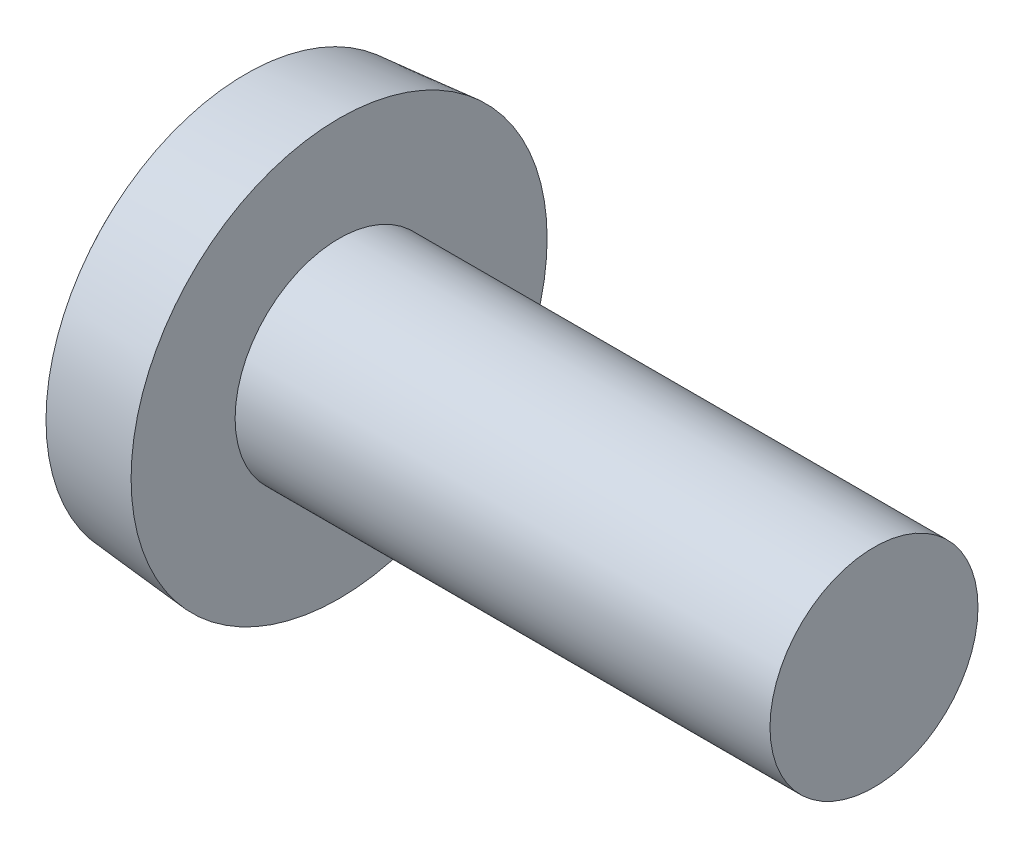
ISO-10303-21;
HEADER;
FILE_DESCRIPTION(('STEP AP214'),'2;1');
FILE_NAME('part.step','',(''),(''),'','','');
FILE_SCHEMA(('AUTOMOTIVE_DESIGN { 1 0 10303 214 1 1 1 1 }'));
ENDSEC;
DATA;
#1=APPLICATION_CONTEXT('core data for automotive mechanical design processes');
#2=APPLICATION_PROTOCOL_DEFINITION('international standard','automotive_design',2000,#1);
#3=PRODUCT_CONTEXT('',#1,'mechanical');
#4=PRODUCT('Part','Part','',(#3));
#5=PRODUCT_RELATED_PRODUCT_CATEGORY('part','',(#4));
#6=PRODUCT_DEFINITION_FORMATION('','',#4);
#7=PRODUCT_DEFINITION_CONTEXT('part definition',#1,'design');
#8=PRODUCT_DEFINITION('design','',#6,#7);
#9=PRODUCT_DEFINITION_SHAPE('','',#8);
#10=(LENGTH_UNIT() NAMED_UNIT(*) SI_UNIT(.MILLI.,.METRE.));
#11=(NAMED_UNIT(*) PLANE_ANGLE_UNIT() SI_UNIT($,.RADIAN.));
#12=(NAMED_UNIT(*) SI_UNIT($,.STERADIAN.) SOLID_ANGLE_UNIT());
#13=UNCERTAINTY_MEASURE_WITH_UNIT(LENGTH_MEASURE(1.E-05),#10,'distance_accuracy_value','');
#14=(GEOMETRIC_REPRESENTATION_CONTEXT(3) GLOBAL_UNCERTAINTY_ASSIGNED_CONTEXT((#13)) GLOBAL_UNIT_ASSIGNED_CONTEXT((#10,
#11,#12)) REPRESENTATION_CONTEXT('',''));
#15=CARTESIAN_POINT('',(0.,0.,0.));
#16=DIRECTION('',(0.,0.,1.));
#17=DIRECTION('',(1.,0.,0.));
#18=AXIS2_PLACEMENT_3D('',#15,#16,#17);
#19=CARTESIAN_POINT('',(-1.56911594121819,0.,0.));
#20=DIRECTION('',(1.,0.,0.));
#21=DIRECTION('',(0.,0.,-1.));
#22=AXIS2_PLACEMENT_3D('',#19,#20,#21);
#23=CONICAL_SURFACE('',#22,3.3627201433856,0.0872664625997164);
#24=CARTESIAN_POINT('',(0.,0.,0.));
#25=DIRECTION('',(-1.,0.,0.));
#26=DIRECTION('',(0.,0.,1.));
#27=AXIS2_PLACEMENT_3D('',#24,#25,#26);
#28=CIRCLE('',#27,3.5);
#29=CARTESIAN_POINT('',(0.,0.,3.5));
#30=VERTEX_POINT('',#29);
#31=EDGE_CURVE('E194',#30,#30,#28,.T.);
#32=ORIENTED_EDGE('',*,*,#31,.T.);
#33=EDGE_LOOP('',(#32));
#34=FACE_BOUND('',#33,.T.);
#35=CARTESIAN_POINT('',(-1.56911594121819,0.,0.));
#36=DIRECTION('',(-1.,0.,0.));
#37=DIRECTION('',(0.,0.,1.));
#38=AXIS2_PLACEMENT_3D('',#35,#36,#37);
#39=CIRCLE('',#38,3.3627201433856);
#40=CARTESIAN_POINT('',(-1.56911594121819,0.,3.3627201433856));
#41=VERTEX_POINT('',#40);
#42=EDGE_CURVE('E190',#41,#41,#39,.T.);
#43=ORIENTED_EDGE('',*,*,#42,.F.);
#44=EDGE_LOOP('',(#43));
#45=FACE_BOUND('',#44,.T.);
#46=ADVANCED_FACE('F33',(#34,#45),#23,.T.);
#47=CARTESIAN_POINT('',(0.,3.5,0.));
#48=DIRECTION('',(1.,0.,0.));
#49=DIRECTION('',(0.,0.,-1.));
#50=AXIS2_PLACEMENT_3D('',#47,#48,#49);
#51=PLANE('',#50);
#52=CARTESIAN_POINT('',(0.,0.,0.));
#53=DIRECTION('',(1.,0.,0.));
#54=DIRECTION('',(0.,0.,-1.));
#55=AXIS2_PLACEMENT_3D('',#52,#53,#54);
#56=CIRCLE('',#55,1.75);
#57=CARTESIAN_POINT('',(0.,0.,-1.75));
#58=VERTEX_POINT('',#57);
#59=EDGE_CURVE('E191',#58,#58,#56,.T.);
#60=ORIENTED_EDGE('',*,*,#59,.F.);
#61=EDGE_LOOP('',(#60));
#62=FACE_BOUND('',#61,.T.);
#63=ORIENTED_EDGE('',*,*,#31,.F.);
#64=EDGE_LOOP('',(#63));
#65=FACE_BOUND('',#64,.T.);
#66=ADVANCED_FACE('F275',(#62,#65),#51,.T.);
#67=CARTESIAN_POINT('',(2.86502031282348,0.,0.));
#68=DIRECTION('',(-1.,0.,0.));
#69=DIRECTION('',(0.,-1.,0.));
#70=AXIS2_PLACEMENT_3D('',#67,#68,#69);
#71=SPHERICAL_SURFACE('',#70,5.56502031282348);
#72=CARTESIAN_POINT('',(2.86502031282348,0.5,0.));
#73=DIRECTION('',(0.,1.,0.));
#74=DIRECTION('',(0.,0.,1.));
#75=AXIS2_PLACEMENT_3D('',#72,#73,#74);
#76=CIRCLE('',#75,5.54251306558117);
#77=CARTESIAN_POINT('',(-2.2002487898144,0.5,2.25));
#78=VERTEX_POINT('',#77);
#79=CARTESIAN_POINT('',(-2.65489373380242,0.5,0.5));
#80=VERTEX_POINT('',#79);
#81=EDGE_CURVE('E11',#78,#80,#76,.F.);
#82=ORIENTED_EDGE('',*,*,#81,.F.);
#83=CARTESIAN_POINT('',(2.86502031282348,0.,2.25));
#84=DIRECTION('',(0.,0.,1.));
#85=DIRECTION('',(1.,0.,0.));
#86=AXIS2_PLACEMENT_3D('',#83,#84,#85);
#87=CIRCLE('',#86,5.08988713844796);
#88=CARTESIAN_POINT('',(-2.2002487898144,-0.5,2.25));
#89=VERTEX_POINT('',#88);
#90=EDGE_CURVE('E122',#89,#78,#87,.F.);
#91=ORIENTED_EDGE('',*,*,#90,.F.);
#92=CARTESIAN_POINT('',(2.86502031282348,-0.5,0.));
#93=DIRECTION('',(0.,-1.,0.));
#94=DIRECTION('',(0.,0.,-1.));
#95=AXIS2_PLACEMENT_3D('',#92,#93,#94);
#96=CIRCLE('',#95,5.54251306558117);
#97=CARTESIAN_POINT('',(-2.65489373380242,-0.5,0.5));
#98=VERTEX_POINT('',#97);
#99=EDGE_CURVE('E200',#98,#89,#96,.F.);
#100=ORIENTED_EDGE('',*,*,#99,.F.);
#101=CARTESIAN_POINT('',(2.86502031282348,0.,0.500000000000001));
#102=DIRECTION('',(0.,0.,1.));
#103=DIRECTION('',(0.,-1.,0.));
#104=AXIS2_PLACEMENT_3D('',#101,#102,#103);
#105=CIRCLE('',#104,5.54251306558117);
#106=CARTESIAN_POINT('',(-2.2002487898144,-2.25,0.499999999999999));
#107=VERTEX_POINT('',#106);
#108=EDGE_CURVE('E202',#107,#98,#105,.F.);
#109=ORIENTED_EDGE('',*,*,#108,.F.);
#110=CARTESIAN_POINT('',(2.86502031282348,-2.25,0.));
#111=DIRECTION('',(0.,-1.,0.));
#112=DIRECTION('',(0.,0.,-1.));
#113=AXIS2_PLACEMENT_3D('',#110,#111,#112);
#114=CIRCLE('',#113,5.08988713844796);
#115=CARTESIAN_POINT('',(-2.2002487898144,-2.25,-0.500000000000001));
#116=VERTEX_POINT('',#115);
#117=EDGE_CURVE('E204',#116,#107,#114,.F.);
#118=ORIENTED_EDGE('',*,*,#117,.F.);
#119=CARTESIAN_POINT('',(2.86502031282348,0.,-0.499999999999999));
#120=DIRECTION('',(0.,0.,-1.));
#121=DIRECTION('',(0.,1.,0.));
#122=AXIS2_PLACEMENT_3D('',#119,#120,#121);
#123=CIRCLE('',#122,5.54251306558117);
#124=CARTESIAN_POINT('',(-2.65489373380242,-0.5,-0.5));
#125=VERTEX_POINT('',#124);
#126=EDGE_CURVE('E206',#125,#116,#123,.F.);
#127=ORIENTED_EDGE('',*,*,#126,.F.);
#128=CARTESIAN_POINT('',(2.86502031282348,-0.5,0.));
#129=DIRECTION('',(0.,-1.,0.));
#130=DIRECTION('',(0.,0.,-1.));
#131=AXIS2_PLACEMENT_3D('',#128,#129,#130);
#132=CIRCLE('',#131,5.54251306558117);
#133=CARTESIAN_POINT('',(-2.2002487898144,-0.5,-2.25));
#134=VERTEX_POINT('',#133);
#135=EDGE_CURVE('E208',#134,#125,#132,.F.);
#136=ORIENTED_EDGE('',*,*,#135,.F.);
#137=CARTESIAN_POINT('',(2.86502031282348,0.,-2.25));
#138=DIRECTION('',(0.,0.,-1.));
#139=DIRECTION('',(-1.,0.,0.));
#140=AXIS2_PLACEMENT_3D('',#137,#138,#139);
#141=CIRCLE('',#140,5.08988713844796);
#142=CARTESIAN_POINT('',(-2.2002487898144,0.5,-2.25));
#143=VERTEX_POINT('',#142);
#144=EDGE_CURVE('E210',#143,#134,#141,.F.);
#145=ORIENTED_EDGE('',*,*,#144,.F.);
#146=CARTESIAN_POINT('',(2.86502031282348,0.5,0.));
#147=DIRECTION('',(0.,1.,0.));
#148=DIRECTION('',(0.,0.,1.));
#149=AXIS2_PLACEMENT_3D('',#146,#147,#148);
#150=CIRCLE('',#149,5.54251306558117);
#151=CARTESIAN_POINT('',(-2.65489373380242,0.5,-0.5));
#152=VERTEX_POINT('',#151);
#153=EDGE_CURVE('E212',#152,#143,#150,.F.);
#154=ORIENTED_EDGE('',*,*,#153,.F.);
#155=CARTESIAN_POINT('',(2.86502031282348,0.,-0.499999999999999));
#156=DIRECTION('',(0.,0.,-1.));
#157=DIRECTION('',(0.,1.,0.));
#158=AXIS2_PLACEMENT_3D('',#155,#156,#157);
#159=CIRCLE('',#158,5.54251306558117);
#160=CARTESIAN_POINT('',(-2.2002487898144,2.25,-0.500000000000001));
#161=VERTEX_POINT('',#160);
#162=EDGE_CURVE('E214',#161,#152,#159,.F.);
#163=ORIENTED_EDGE('',*,*,#162,.F.);
#164=CARTESIAN_POINT('',(2.86502031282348,2.25,0.));
#165=DIRECTION('',(0.,1.,0.));
#166=DIRECTION('',(0.,0.,1.));
#167=AXIS2_PLACEMENT_3D('',#164,#165,#166);
#168=CIRCLE('',#167,5.08988713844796);
#169=CARTESIAN_POINT('',(-2.2002487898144,2.25,0.499999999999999));
#170=VERTEX_POINT('',#169);
#171=EDGE_CURVE('E216',#170,#161,#168,.F.);
#172=ORIENTED_EDGE('',*,*,#171,.F.);
#173=CARTESIAN_POINT('',(2.86502031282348,0.,0.5));
#174=DIRECTION('',(0.,0.,1.));
#175=DIRECTION('',(0.,-1.,0.));
#176=AXIS2_PLACEMENT_3D('',#173,#174,#175);
#177=CIRCLE('',#176,5.54251306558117);
#178=EDGE_CURVE('E40',#80,#170,#177,.F.);
#179=ORIENTED_EDGE('',*,*,#178,.F.);
#180=EDGE_LOOP('',(#82,#91,#100,#109,#118,#127,#136,#145,#154,#163,#172,#179));
#181=FACE_BOUND('',#180,.T.);
#182=ORIENTED_EDGE('',*,*,#42,.T.);
#183=EDGE_LOOP('',(#182));
#184=FACE_BOUND('',#183,.T.);
#185=ADVANCED_FACE('F228',(#181,#184),#71,.T.);
#186=CARTESIAN_POINT('',(9.,0.,0.));
#187=DIRECTION('',(-1.,0.,0.));
#188=DIRECTION('',(0.,0.,1.));
#189=AXIS2_PLACEMENT_3D('',#186,#187,#188);
#190=CYLINDRICAL_SURFACE('',#189,1.75);
#191=CARTESIAN_POINT('',(9.,0.,0.));
#192=DIRECTION('',(1.,0.,0.));
#193=DIRECTION('',(0.,0.,-1.));
#194=AXIS2_PLACEMENT_3D('',#191,#192,#193);
#195=CIRCLE('',#194,1.75);
#196=CARTESIAN_POINT('',(9.,0.,-1.75));
#197=VERTEX_POINT('',#196);
#198=EDGE_CURVE('E168',#197,#197,#195,.T.);
#199=ORIENTED_EDGE('',*,*,#198,.F.);
#200=EDGE_LOOP('',(#199));
#201=FACE_BOUND('',#200,.T.);
#202=ORIENTED_EDGE('',*,*,#59,.T.);
#203=EDGE_LOOP('',(#202));
#204=FACE_BOUND('',#203,.T.);
#205=ADVANCED_FACE('F285',(#201,#204),#190,.T.);
#206=CARTESIAN_POINT('',(9.,0.,0.));
#207=DIRECTION('',(1.,0.,0.));
#208=DIRECTION('',(0.,0.,-1.));
#209=AXIS2_PLACEMENT_3D('',#206,#207,#208);
#210=PLANE('',#209);
#211=ORIENTED_EDGE('',*,*,#198,.T.);
#212=EDGE_LOOP('',(#211));
#213=FACE_BOUND('',#212,.T.);
#214=ADVANCED_FACE('F290',(#213),#210,.T.);
#215=CARTESIAN_POINT('',(-2.7,0.5,0.5));
#216=DIRECTION('',(0.,1.,0.));
#217=DIRECTION('',(0.,0.,1.));
#218=AXIS2_PLACEMENT_3D('',#215,#216,#217);
#219=PLANE('',#218);
#220=ORIENTED_EDGE('',*,*,#81,.T.);
#221=DIRECTION('',(1.,0.,0.));
#222=VECTOR('',#221,1.);
#223=CARTESIAN_POINT('',(-2.7,0.5,0.5));
#224=LINE('',#223,#222);
#225=CARTESIAN_POINT('',(-0.699999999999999,0.5,0.5));
#226=VERTEX_POINT('',#225);
#227=EDGE_CURVE('E138',#80,#226,#224,.T.);
#228=ORIENTED_EDGE('',*,*,#227,.T.);
#229=DIRECTION('',(0.,0.,1.));
#230=VECTOR('',#229,1.);
#231=CARTESIAN_POINT('',(-0.699999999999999,0.5,0.5));
#232=LINE('',#231,#230);
#233=CARTESIAN_POINT('',(-0.699999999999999,0.5,2.25));
#234=VERTEX_POINT('',#233);
#235=EDGE_CURVE('E131',#226,#234,#232,.T.);
#236=ORIENTED_EDGE('',*,*,#235,.T.);
#237=DIRECTION('',(1.,0.,0.));
#238=VECTOR('',#237,1.);
#239=CARTESIAN_POINT('',(-2.7,0.5,2.25));
#240=LINE('',#239,#238);
#241=EDGE_CURVE('E117',#78,#234,#240,.T.);
#242=ORIENTED_EDGE('',*,*,#241,.F.);
#243=EDGE_LOOP('',(#220,#228,#236,#242));
#244=FACE_BOUND('',#243,.T.);
#245=ADVANCED_FACE('F137',(#244),#219,.F.);
#246=CARTESIAN_POINT('',(-2.7,2.25,0.499999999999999));
#247=DIRECTION('',(0.,0.,1.));
#248=DIRECTION('',(0.,-1.,0.));
#249=AXIS2_PLACEMENT_3D('',#246,#247,#248);
#250=PLANE('',#249);
#251=ORIENTED_EDGE('',*,*,#178,.T.);
#252=DIRECTION('',(1.,0.,0.));
#253=VECTOR('',#252,1.);
#254=CARTESIAN_POINT('',(-2.7,2.25,0.499999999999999));
#255=LINE('',#254,#253);
#256=CARTESIAN_POINT('',(-0.699999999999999,2.25,0.499999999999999));
#257=VERTEX_POINT('',#256);
#258=EDGE_CURVE('E169',#170,#257,#255,.T.);
#259=ORIENTED_EDGE('',*,*,#258,.T.);
#260=DIRECTION('',(0.,-1.,0.));
#261=VECTOR('',#260,1.);
#262=CARTESIAN_POINT('',(-0.699999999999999,2.25,0.499999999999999));
#263=LINE('',#262,#261);
#264=EDGE_CURVE('E124',#257,#226,#263,.T.);
#265=ORIENTED_EDGE('',*,*,#264,.T.);
#266=ORIENTED_EDGE('',*,*,#227,.F.);
#267=EDGE_LOOP('',(#251,#259,#265,#266));
#268=FACE_BOUND('',#267,.T.);
#269=ADVANCED_FACE('F220',(#268),#250,.F.);
#270=CARTESIAN_POINT('',(-2.7,2.25,-0.500000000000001));
#271=DIRECTION('',(0.,1.,0.));
#272=DIRECTION('',(0.,0.,1.));
#273=AXIS2_PLACEMENT_3D('',#270,#271,#272);
#274=PLANE('',#273);
#275=ORIENTED_EDGE('',*,*,#171,.T.);
#276=DIRECTION('',(1.,0.,0.));
#277=VECTOR('',#276,1.);
#278=CARTESIAN_POINT('',(-2.7,2.25,-0.500000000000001));
#279=LINE('',#278,#277);
#280=CARTESIAN_POINT('',(-0.699999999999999,2.25,-0.500000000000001));
#281=VERTEX_POINT('',#280);
#282=EDGE_CURVE('E171',#161,#281,#279,.T.);
#283=ORIENTED_EDGE('',*,*,#282,.T.);
#284=DIRECTION('',(0.,0.,1.));
#285=VECTOR('',#284,1.);
#286=CARTESIAN_POINT('',(-0.699999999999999,2.25,-0.500000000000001));
#287=LINE('',#286,#285);
#288=EDGE_CURVE('E163',#281,#257,#287,.T.);
#289=ORIENTED_EDGE('',*,*,#288,.T.);
#290=ORIENTED_EDGE('',*,*,#258,.F.);
#291=EDGE_LOOP('',(#275,#283,#289,#290));
#292=FACE_BOUND('',#291,.T.);
#293=ADVANCED_FACE('F224',(#292),#274,.F.);
#294=CARTESIAN_POINT('',(-2.7,0.5,-0.5));
#295=DIRECTION('',(0.,0.,-1.));
#296=DIRECTION('',(0.,1.,0.));
#297=AXIS2_PLACEMENT_3D('',#294,#295,#296);
#298=PLANE('',#297);
#299=ORIENTED_EDGE('',*,*,#162,.T.);
#300=DIRECTION('',(1.,0.,0.));
#301=VECTOR('',#300,1.);
#302=CARTESIAN_POINT('',(-2.7,0.5,-0.5));
#303=LINE('',#302,#301);
#304=CARTESIAN_POINT('',(-0.699999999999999,0.5,-0.5));
#305=VERTEX_POINT('',#304);
#306=EDGE_CURVE('E173',#152,#305,#303,.T.);
#307=ORIENTED_EDGE('',*,*,#306,.T.);
#308=DIRECTION('',(0.,1.,0.));
#309=VECTOR('',#308,1.);
#310=CARTESIAN_POINT('',(-0.699999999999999,0.5,-0.5));
#311=LINE('',#310,#309);
#312=EDGE_CURVE('E160',#305,#281,#311,.T.);
#313=ORIENTED_EDGE('',*,*,#312,.T.);
#314=ORIENTED_EDGE('',*,*,#282,.F.);
#315=EDGE_LOOP('',(#299,#307,#313,#314));
#316=FACE_BOUND('',#315,.T.);
#317=ADVANCED_FACE('F234',(#316),#298,.F.);
#318=CARTESIAN_POINT('',(-2.7,0.5,-2.25));
#319=DIRECTION('',(0.,1.,0.));
#320=DIRECTION('',(0.,0.,1.));
#321=AXIS2_PLACEMENT_3D('',#318,#319,#320);
#322=PLANE('',#321);
#323=ORIENTED_EDGE('',*,*,#153,.T.);
#324=DIRECTION('',(1.,0.,0.));
#325=VECTOR('',#324,1.);
#326=CARTESIAN_POINT('',(-2.7,0.5,-2.25));
#327=LINE('',#326,#325);
#328=CARTESIAN_POINT('',(-0.699999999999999,0.5,-2.25));
#329=VERTEX_POINT('',#328);
#330=EDGE_CURVE('E175',#143,#329,#327,.T.);
#331=ORIENTED_EDGE('',*,*,#330,.T.);
#332=DIRECTION('',(0.,0.,1.));
#333=VECTOR('',#332,1.);
#334=CARTESIAN_POINT('',(-0.699999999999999,0.5,-2.25));
#335=LINE('',#334,#333);
#336=EDGE_CURVE('E157',#329,#305,#335,.T.);
#337=ORIENTED_EDGE('',*,*,#336,.T.);
#338=ORIENTED_EDGE('',*,*,#306,.F.);
#339=EDGE_LOOP('',(#323,#331,#337,#338));
#340=FACE_BOUND('',#339,.T.);
#341=ADVANCED_FACE('F237',(#340),#322,.F.);
#342=CARTESIAN_POINT('',(-2.7,-0.5,-2.25));
#343=DIRECTION('',(0.,0.,-1.));
#344=DIRECTION('',(-1.,0.,0.));
#345=AXIS2_PLACEMENT_3D('',#342,#343,#344);
#346=PLANE('',#345);
#347=ORIENTED_EDGE('',*,*,#144,.T.);
#348=DIRECTION('',(1.,0.,0.));
#349=VECTOR('',#348,1.);
#350=CARTESIAN_POINT('',(-2.7,-0.5,-2.25));
#351=LINE('',#350,#349);
#352=CARTESIAN_POINT('',(-0.699999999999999,-0.5,-2.25));
#353=VERTEX_POINT('',#352);
#354=EDGE_CURVE('E177',#134,#353,#351,.T.);
#355=ORIENTED_EDGE('',*,*,#354,.T.);
#356=DIRECTION('',(0.,1.,0.));
#357=VECTOR('',#356,1.);
#358=CARTESIAN_POINT('',(-0.699999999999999,-0.5,-2.25));
#359=LINE('',#358,#357);
#360=EDGE_CURVE('E154',#353,#329,#359,.T.);
#361=ORIENTED_EDGE('',*,*,#360,.T.);
#362=ORIENTED_EDGE('',*,*,#330,.F.);
#363=EDGE_LOOP('',(#347,#355,#361,#362));
#364=FACE_BOUND('',#363,.T.);
#365=ADVANCED_FACE('F243',(#364),#346,.F.);
#366=CARTESIAN_POINT('',(-2.7,-0.5,-0.5));
#367=DIRECTION('',(0.,-1.,0.));
#368=DIRECTION('',(0.,0.,-1.));
#369=AXIS2_PLACEMENT_3D('',#366,#367,#368);
#370=PLANE('',#369);
#371=ORIENTED_EDGE('',*,*,#135,.T.);
#372=DIRECTION('',(1.,0.,0.));
#373=VECTOR('',#372,1.);
#374=CARTESIAN_POINT('',(-2.7,-0.5,-0.5));
#375=LINE('',#374,#373);
#376=CARTESIAN_POINT('',(-0.699999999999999,-0.5,-0.5));
#377=VERTEX_POINT('',#376);
#378=EDGE_CURVE('E179',#125,#377,#375,.T.);
#379=ORIENTED_EDGE('',*,*,#378,.T.);
#380=DIRECTION('',(0.,0.,-1.));
#381=VECTOR('',#380,1.);
#382=CARTESIAN_POINT('',(-0.699999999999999,-0.5,-0.5));
#383=LINE('',#382,#381);
#384=EDGE_CURVE('E151',#377,#353,#383,.T.);
#385=ORIENTED_EDGE('',*,*,#384,.T.);
#386=ORIENTED_EDGE('',*,*,#354,.F.);
#387=EDGE_LOOP('',(#371,#379,#385,#386));
#388=FACE_BOUND('',#387,.T.);
#389=ADVANCED_FACE('F247',(#388),#370,.F.);
#390=CARTESIAN_POINT('',(-2.7,-2.25,-0.500000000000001));
#391=DIRECTION('',(0.,0.,-1.));
#392=DIRECTION('',(0.,1.,0.));
#393=AXIS2_PLACEMENT_3D('',#390,#391,#392);
#394=PLANE('',#393);
#395=ORIENTED_EDGE('',*,*,#126,.T.);
#396=DIRECTION('',(1.,0.,0.));
#397=VECTOR('',#396,1.);
#398=CARTESIAN_POINT('',(-2.7,-2.25,-0.500000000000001));
#399=LINE('',#398,#397);
#400=CARTESIAN_POINT('',(-0.699999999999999,-2.25,-0.500000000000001));
#401=VERTEX_POINT('',#400);
#402=EDGE_CURVE('E181',#116,#401,#399,.T.);
#403=ORIENTED_EDGE('',*,*,#402,.T.);
#404=DIRECTION('',(0.,1.,0.));
#405=VECTOR('',#404,1.);
#406=CARTESIAN_POINT('',(-0.699999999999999,-2.25,-0.500000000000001));
#407=LINE('',#406,#405);
#408=EDGE_CURVE('E148',#401,#377,#407,.T.);
#409=ORIENTED_EDGE('',*,*,#408,.T.);
#410=ORIENTED_EDGE('',*,*,#378,.F.);
#411=EDGE_LOOP('',(#395,#403,#409,#410));
#412=FACE_BOUND('',#411,.T.);
#413=ADVANCED_FACE('F254',(#412),#394,.F.);
#414=CARTESIAN_POINT('',(-2.7,-2.25,0.499999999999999));
#415=DIRECTION('',(0.,-1.,0.));
#416=DIRECTION('',(0.,0.,-1.));
#417=AXIS2_PLACEMENT_3D('',#414,#415,#416);
#418=PLANE('',#417);
#419=ORIENTED_EDGE('',*,*,#117,.T.);
#420=DIRECTION('',(1.,0.,0.));
#421=VECTOR('',#420,1.);
#422=CARTESIAN_POINT('',(-2.7,-2.25,0.499999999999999));
#423=LINE('',#422,#421);
#424=CARTESIAN_POINT('',(-0.699999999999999,-2.25,0.499999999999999));
#425=VERTEX_POINT('',#424);
#426=EDGE_CURVE('E183',#107,#425,#423,.T.);
#427=ORIENTED_EDGE('',*,*,#426,.T.);
#428=DIRECTION('',(0.,0.,-1.));
#429=VECTOR('',#428,1.);
#430=CARTESIAN_POINT('',(-0.699999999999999,-2.25,0.499999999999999));
#431=LINE('',#430,#429);
#432=EDGE_CURVE('E145',#425,#401,#431,.T.);
#433=ORIENTED_EDGE('',*,*,#432,.T.);
#434=ORIENTED_EDGE('',*,*,#402,.F.);
#435=EDGE_LOOP('',(#419,#427,#433,#434));
#436=FACE_BOUND('',#435,.T.);
#437=ADVANCED_FACE('F257',(#436),#418,.F.);
#438=CARTESIAN_POINT('',(-2.7,-0.5,0.5));
#439=DIRECTION('',(0.,0.,1.));
#440=DIRECTION('',(0.,-1.,0.));
#441=AXIS2_PLACEMENT_3D('',#438,#439,#440);
#442=PLANE('',#441);
#443=ORIENTED_EDGE('',*,*,#108,.T.);
#444=DIRECTION('',(1.,0.,0.));
#445=VECTOR('',#444,1.);
#446=CARTESIAN_POINT('',(-2.7,-0.5,0.5));
#447=LINE('',#446,#445);
#448=CARTESIAN_POINT('',(-0.699999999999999,-0.5,0.5));
#449=VERTEX_POINT('',#448);
#450=EDGE_CURVE('E185',#98,#449,#447,.T.);
#451=ORIENTED_EDGE('',*,*,#450,.T.);
#452=DIRECTION('',(0.,-1.,0.));
#453=VECTOR('',#452,1.);
#454=CARTESIAN_POINT('',(-0.699999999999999,-0.5,0.5));
#455=LINE('',#454,#453);
#456=EDGE_CURVE('E142',#449,#425,#455,.T.);
#457=ORIENTED_EDGE('',*,*,#456,.T.);
#458=ORIENTED_EDGE('',*,*,#426,.F.);
#459=EDGE_LOOP('',(#443,#451,#457,#458));
#460=FACE_BOUND('',#459,.T.);
#461=ADVANCED_FACE('F261',(#460),#442,.F.);
#462=CARTESIAN_POINT('',(-2.7,-0.5,2.25));
#463=DIRECTION('',(0.,-1.,0.));
#464=DIRECTION('',(0.,0.,-1.));
#465=AXIS2_PLACEMENT_3D('',#462,#463,#464);
#466=PLANE('',#465);
#467=ORIENTED_EDGE('',*,*,#99,.T.);
#468=DIRECTION('',(1.,0.,0.));
#469=VECTOR('',#468,1.);
#470=CARTESIAN_POINT('',(-2.7,-0.5,2.25));
#471=LINE('',#470,#469);
#472=CARTESIAN_POINT('',(-0.699999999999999,-0.5,2.25));
#473=VERTEX_POINT('',#472);
#474=EDGE_CURVE('E47',#89,#473,#471,.T.);
#475=ORIENTED_EDGE('',*,*,#474,.T.);
#476=DIRECTION('',(0.,0.,-1.));
#477=VECTOR('',#476,1.);
#478=CARTESIAN_POINT('',(-0.699999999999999,-0.5,2.25));
#479=LINE('',#478,#477);
#480=EDGE_CURVE('E135',#473,#449,#479,.T.);
#481=ORIENTED_EDGE('',*,*,#480,.T.);
#482=ORIENTED_EDGE('',*,*,#450,.F.);
#483=EDGE_LOOP('',(#467,#475,#481,#482));
#484=FACE_BOUND('',#483,.T.);
#485=ADVANCED_FACE('F265',(#484),#466,.F.);
#486=CARTESIAN_POINT('',(-2.7,0.5,2.25));
#487=DIRECTION('',(0.,0.,1.));
#488=DIRECTION('',(1.,0.,0.));
#489=AXIS2_PLACEMENT_3D('',#486,#487,#488);
#490=PLANE('',#489);
#491=ORIENTED_EDGE('',*,*,#90,.T.);
#492=ORIENTED_EDGE('',*,*,#241,.T.);
#493=DIRECTION('',(0.,-1.,0.));
#494=VECTOR('',#493,1.);
#495=CARTESIAN_POINT('',(-0.699999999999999,0.5,2.25));
#496=LINE('',#495,#494);
#497=EDGE_CURVE('E120',#234,#473,#496,.T.);
#498=ORIENTED_EDGE('',*,*,#497,.T.);
#499=ORIENTED_EDGE('',*,*,#474,.F.);
#500=EDGE_LOOP('',(#491,#492,#498,#499));
#501=FACE_BOUND('',#500,.T.);
#502=ADVANCED_FACE('F119',(#501),#490,.F.);
#503=CARTESIAN_POINT('',(-0.699999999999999,0.,0.));
#504=DIRECTION('',(1.,0.,0.));
#505=DIRECTION('',(0.,0.,-1.));
#506=AXIS2_PLACEMENT_3D('',#503,#504,#505);
#507=PLANE('',#506);
#508=ORIENTED_EDGE('',*,*,#235,.F.);
#509=ORIENTED_EDGE('',*,*,#264,.F.);
#510=ORIENTED_EDGE('',*,*,#288,.F.);
#511=ORIENTED_EDGE('',*,*,#312,.F.);
#512=ORIENTED_EDGE('',*,*,#336,.F.);
#513=ORIENTED_EDGE('',*,*,#360,.F.);
#514=ORIENTED_EDGE('',*,*,#384,.F.);
#515=ORIENTED_EDGE('',*,*,#408,.F.);
#516=ORIENTED_EDGE('',*,*,#432,.F.);
#517=ORIENTED_EDGE('',*,*,#456,.F.);
#518=ORIENTED_EDGE('',*,*,#480,.F.);
#519=ORIENTED_EDGE('',*,*,#497,.F.);
#520=EDGE_LOOP('',(#508,#509,#510,#511,#512,#513,#514,#515,#516,#517,#518,#519));
#521=FACE_BOUND('',#520,.T.);
#522=ADVANCED_FACE('F129',(#521),#507,.F.);
#523=CLOSED_SHELL('',(#46,#66,#185,#205,#214,#245,#269,#293,#317,#341,#365,#389,#413,#437,#461,
#485,#502,#522));
#524=MANIFOLD_SOLID_BREP('B2',#523);
#525=ADVANCED_BREP_SHAPE_REPRESENTATION('',(#18,#524),#14);
#526=SHAPE_DEFINITION_REPRESENTATION(#9,#525);
ENDSEC;
END-ISO-10303-21;
